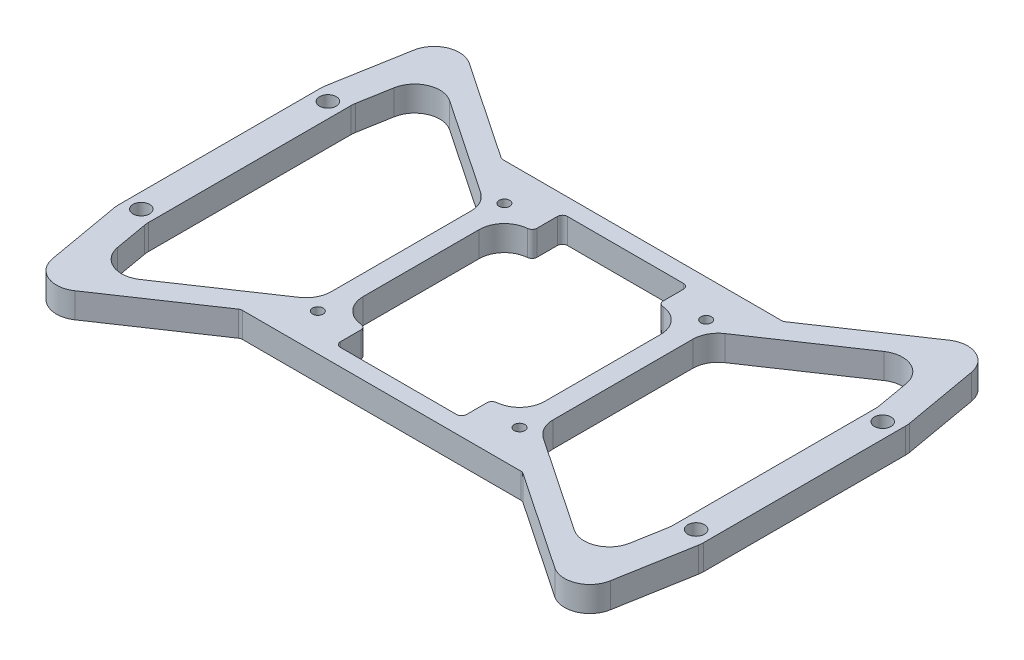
from build123d import *

# Parameters (mm, degrees)
SKETCH1_R           = 1.65
SKETCH1_R_2         = 1.05
SKETCH1_W           = 4
SKETCH1_H           = 33
BOSS_EXTRUDE1_DEPTH = 5
FILLET1_R           = 5
SKETCH3_W           = 55.867355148
SKETCH3_H           = 5.348236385
BOSS_EXTRUDE2_DEPTH = 5
SKETCH2_W           = 25
SKETCH2_H           = 6
CUT_EXTRUDE1_DEPTH  = 71.602680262
FILLET2_R           = 1
FILLET3_R           = 1


with BuildPart() as part:
    # Sketch1 → Boss-Extrude1 (new body)
    # profile 1 of 3: a face of its own
    with BuildSketch(Plane(origin=(0, 0, 0), x_dir=(1, 0, 0), z_dir=(0, 1, 0))):
        Polygon((-58, 20.5), (-58, -20.5), (-53.962982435, -43.395064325), (-20, -20.5), (20, -20.5), (53.962982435, -43.395064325), (58, -20.5), (58, 20.5), (53.962982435, 43.395064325), (20, 20.5), (-20, 20.5), (-53.962982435, 43.395064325), align=None)
        with Locations(Location((55, 18.5, 0), (0, 0, 270))):
            Circle(SKETCH1_R, mode=Mode.SUBTRACT)
        with Locations(Location((55, -18.5, 0), (0, 0, 270))):
            Circle(SKETCH1_R, mode=Mode.SUBTRACT)
        with Locations(Location((-55, -18.5, 0), (0, 0, 270))):
            Circle(SKETCH1_R, mode=Mode.SUBTRACT)
        with Locations(Location((-55, 18.5, 0), (0, 0, 270))):
            Circle(SKETCH1_R, mode=Mode.SUBTRACT)
        with Locations(Location((-20, -18.5, 0), (0, 0, 270))):
            Circle(SKETCH1_R_2, mode=Mode.SUBTRACT)
        with Locations(Location((20, -18.5, 0), (0, 0, 270))):
            Circle(SKETCH1_R_2, mode=Mode.SUBTRACT)
        with Locations(Location((20, 18.5, 0), (0, 0, 270))):
            Circle(SKETCH1_R_2, mode=Mode.SUBTRACT)
        with Locations(Location((-20, 18.5, 0), (0, 0, 270))):
            Circle(SKETCH1_R_2, mode=Mode.SUBTRACT)
        Polygon((-22, -16.5), (-49.44325878, -35), (-52, -20.5), (-52, 20.5), (-49.44325878, 35), (-22, 16.5), (22, 16.5), (49.44325878, 35), (52, 20.5), (52, -20.5), (49.44325878, -35), (22, -16.5), align=None, mode=Mode.SUBTRACT)
    # profile 2 of 3: a face of its own
    with BuildSketch(Plane(origin=(0, 0, 0), x_dir=(1, 0, 0), z_dir=(0, 1, 0))):
        with Locations((-20, 0)):
            Rectangle(SKETCH1_W, SKETCH1_H)
    # profile 3 of 3: a face of its own
    with BuildSketch(Plane(origin=(0, 0, 0), x_dir=(1, 0, 0), z_dir=(0, 1, 0))):
        with Locations((20, 0)):
            Rectangle(SKETCH1_W, SKETCH1_H)
    extrude(amount=BOSS_EXTRUDE1_DEPTH)

    # Fillet1
    fillet1_edges = [part.edges().sort_by_distance(p)[0] for p in [
        (-58, 2.5, -20.5),
        (-53.962982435, 2.5, -43.395064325),
        (-20, 2.5, -20.5),
        (20, 2.5, -20.5),
        (53.962982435, 2.5, -43.395064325),
        (58, 2.5, -20.5),
        (58, 2.5, 20.5),
        (53.962982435, 2.5, 43.395064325),
        (20, 2.5, 20.5),
        (-20, 2.5, 20.5),
        (-53.962982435, 2.5, 43.395064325),
        (-58, 2.5, 20.5),
        (22, 2.5, 16.5),
        (49.44325878, 2.5, 35),
        (52, 2.5, 20.5),
        (52, 2.5, -20.5),
        (49.44325878, 2.5, -35),
        (22, 2.5, -16.5),
        (-49.44325878, 2.5, -35),
        (-52, 2.5, -20.5),
        (-52, 2.5, 20.5),
        (-49.44325878, 2.5, 35),
        (-22, 2.5, 16.5),
        (-22, 2.5, -16.5),
        (-18, 2.5, -16.5),
        (-18, 2.5, 16.5),
        (18, 2.5, 16.5),
        (18, 2.5, -16.5),
    ]]
    fillet(fillet1_edges, radius=FILLET1_R)

    # Sketch3 → Boss-Extrude2 (add)
    with BuildSketch(Plane(origin=(0, 5, 0), x_dir=(1, 0, 0), z_dir=(0, 1, 0))):
        with Locations((0, -23.174118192)):
            Rectangle(SKETCH3_W, SKETCH3_H)
    boss_extrude2 = extrude(amount=-BOSS_EXTRUDE2_DEPTH)

    # Sketch2 → Cut-Extrude1 (cut, through all)
    with BuildSketch(Plane(origin=(0, 5, 0), x_dir=(1, 0, 0), z_dir=(0, 1, 0))):
        with Locations((0, -19.5)):
            Rectangle(SKETCH2_W, SKETCH2_H)
    cut_extrude1 = extrude(amount=-CUT_EXTRUDE1_DEPTH, mode=Mode.SUBTRACT)

    # Fillet2
    fillet2_edges = [part.edges().sort_by_distance(p)[0] for p in [
        (27.933677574, 2.5, 25.848236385),
        (-27.933677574, 2.5, 25.848236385),
        (-12.5, 2.5, 16.5),
        (-12.5, 2.5, 22.5),
        (12.5, 2.5, 22.5),
        (12.5, 2.5, 16.5),
    ]]
    fillet(fillet2_edges, radius=FILLET2_R)

    # Mirror1: Boss-Extrude2, Cut-Extrude1 across plane
    add(boss_extrude2.mirror(Plane.XY))
    add(cut_extrude1.mirror(Plane.XY), mode=Mode.SUBTRACT)

    # Fillet3
    fillet3_edges = [part.edges().sort_by_distance(p)[0] for p in [
        (-27.933677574, 2.5, -25.848236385),
        (27.933677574, 2.5, -25.848236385),
        (12.5, 2.5, -22.5),
        (12.5, 2.5, -16.5),
        (-12.5, 2.5, -16.5),
        (-12.5, 2.5, -22.5),
    ]]
    fillet(fillet3_edges, radius=FILLET3_R)


solid = part.part
